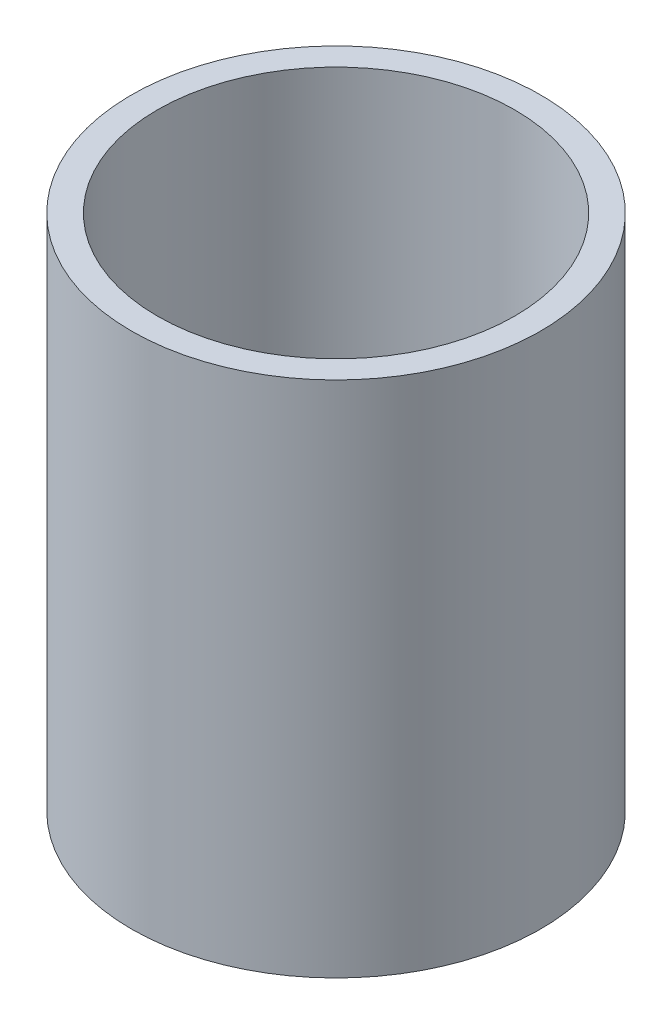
ISO-10303-21;
HEADER;
FILE_DESCRIPTION(('STEP AP214'),'2;1');
FILE_NAME('part.step','',(''),(''),'','','');
FILE_SCHEMA(('AUTOMOTIVE_DESIGN { 1 0 10303 214 1 1 1 1 }'));
ENDSEC;
DATA;
#1=APPLICATION_CONTEXT('core data for automotive mechanical design processes');
#2=APPLICATION_PROTOCOL_DEFINITION('international standard','automotive_design',2000,#1);
#3=PRODUCT_CONTEXT('',#1,'mechanical');
#4=PRODUCT('Part','Part','',(#3));
#5=PRODUCT_RELATED_PRODUCT_CATEGORY('part','',(#4));
#6=PRODUCT_DEFINITION_FORMATION('','',#4);
#7=PRODUCT_DEFINITION_CONTEXT('part definition',#1,'design');
#8=PRODUCT_DEFINITION('design','',#6,#7);
#9=PRODUCT_DEFINITION_SHAPE('','',#8);
#10=(LENGTH_UNIT() NAMED_UNIT(*) SI_UNIT(.MILLI.,.METRE.));
#11=(NAMED_UNIT(*) PLANE_ANGLE_UNIT() SI_UNIT($,.RADIAN.));
#12=(NAMED_UNIT(*) SI_UNIT($,.STERADIAN.) SOLID_ANGLE_UNIT());
#13=UNCERTAINTY_MEASURE_WITH_UNIT(LENGTH_MEASURE(1.E-05),#10,'distance_accuracy_value','');
#14=(GEOMETRIC_REPRESENTATION_CONTEXT(3) GLOBAL_UNCERTAINTY_ASSIGNED_CONTEXT((#13)) GLOBAL_UNIT_ASSIGNED_CONTEXT((#10,
#11,#12)) REPRESENTATION_CONTEXT('',''));
#15=CARTESIAN_POINT('',(0.,0.,0.));
#16=DIRECTION('',(0.,0.,1.));
#17=DIRECTION('',(1.,0.,0.));
#18=AXIS2_PLACEMENT_3D('',#15,#16,#17);
#19=CARTESIAN_POINT('',(0.,25.4,0.));
#20=DIRECTION('',(0.,1.,0.));
#21=DIRECTION('',(0.,0.,1.));
#22=AXIS2_PLACEMENT_3D('',#19,#20,#21);
#23=PLANE('',#22);
#24=CARTESIAN_POINT('',(0.,25.4,0.));
#25=DIRECTION('',(0.,1.,0.));
#26=DIRECTION('',(0.,0.,1.));
#27=AXIS2_PLACEMENT_3D('',#24,#25,#26);
#28=CIRCLE('',#27,10.033);
#29=CARTESIAN_POINT('',(0.,25.4,10.033));
#30=VERTEX_POINT('',#29);
#31=EDGE_CURVE('E10',#30,#30,#28,.T.);
#32=ORIENTED_EDGE('',*,*,#31,.T.);
#33=EDGE_LOOP('',(#32));
#34=FACE_BOUND('',#33,.T.);
#35=CARTESIAN_POINT('',(0.,25.4,0.));
#36=DIRECTION('',(0.,1.,0.));
#37=DIRECTION('',(0.,0.,1.));
#38=AXIS2_PLACEMENT_3D('',#35,#36,#37);
#39=CIRCLE('',#38,8.763);
#40=CARTESIAN_POINT('',(0.,25.4,8.763));
#41=VERTEX_POINT('',#40);
#42=EDGE_CURVE('E56',#41,#41,#39,.T.);
#43=ORIENTED_EDGE('',*,*,#42,.F.);
#44=EDGE_LOOP('',(#43));
#45=FACE_BOUND('',#44,.T.);
#46=ADVANCED_FACE('F43',(#34,#45),#23,.T.);
#47=CARTESIAN_POINT('',(0.,0.,0.));
#48=DIRECTION('',(0.,1.,0.));
#49=DIRECTION('',(0.,0.,1.));
#50=AXIS2_PLACEMENT_3D('',#47,#48,#49);
#51=PLANE('',#50);
#52=CARTESIAN_POINT('',(0.,0.,0.));
#53=DIRECTION('',(0.,1.,0.));
#54=DIRECTION('',(0.,0.,1.));
#55=AXIS2_PLACEMENT_3D('',#52,#53,#54);
#56=CIRCLE('',#55,10.033);
#57=CARTESIAN_POINT('',(0.,0.,10.033));
#58=VERTEX_POINT('',#57);
#59=EDGE_CURVE('E47',#58,#58,#56,.T.);
#60=ORIENTED_EDGE('',*,*,#59,.F.);
#61=EDGE_LOOP('',(#60));
#62=FACE_BOUND('',#61,.T.);
#63=CARTESIAN_POINT('',(0.,0.,0.));
#64=DIRECTION('',(0.,1.,0.));
#65=DIRECTION('',(0.,0.,1.));
#66=AXIS2_PLACEMENT_3D('',#63,#64,#65);
#67=CIRCLE('',#66,8.763);
#68=CARTESIAN_POINT('',(0.,0.,8.763));
#69=VERTEX_POINT('',#68);
#70=EDGE_CURVE('E58',#69,#69,#67,.T.);
#71=ORIENTED_EDGE('',*,*,#70,.T.);
#72=EDGE_LOOP('',(#71));
#73=FACE_BOUND('',#72,.T.);
#74=ADVANCED_FACE('F70',(#62,#73),#51,.F.);
#75=CARTESIAN_POINT('',(0.,25.4,0.));
#76=DIRECTION('',(0.,-1.,0.));
#77=DIRECTION('',(0.,0.,-1.));
#78=AXIS2_PLACEMENT_3D('',#75,#76,#77);
#79=CYLINDRICAL_SURFACE('',#78,10.033);
#80=ORIENTED_EDGE('',*,*,#31,.F.);
#81=EDGE_LOOP('',(#80));
#82=FACE_BOUND('',#81,.T.);
#83=ORIENTED_EDGE('',*,*,#59,.T.);
#84=EDGE_LOOP('',(#83));
#85=FACE_BOUND('',#84,.T.);
#86=ADVANCED_FACE('F45',(#82,#85),#79,.T.);
#87=CARTESIAN_POINT('',(0.,25.4,0.));
#88=DIRECTION('',(0.,-1.,0.));
#89=DIRECTION('',(0.,0.,-1.));
#90=AXIS2_PLACEMENT_3D('',#87,#88,#89);
#91=CYLINDRICAL_SURFACE('',#90,8.763);
#92=ORIENTED_EDGE('',*,*,#42,.T.);
#93=EDGE_LOOP('',(#92));
#94=FACE_BOUND('',#93,.T.);
#95=ORIENTED_EDGE('',*,*,#70,.F.);
#96=EDGE_LOOP('',(#95));
#97=FACE_BOUND('',#96,.T.);
#98=ADVANCED_FACE('F66',(#94,#97),#91,.F.);
#99=CLOSED_SHELL('',(#46,#74,#86,#98));
#100=MANIFOLD_SOLID_BREP('B2',#99);
#101=ADVANCED_BREP_SHAPE_REPRESENTATION('',(#18,#100),#14);
#102=SHAPE_DEFINITION_REPRESENTATION(#9,#101);
ENDSEC;
END-ISO-10303-21;
